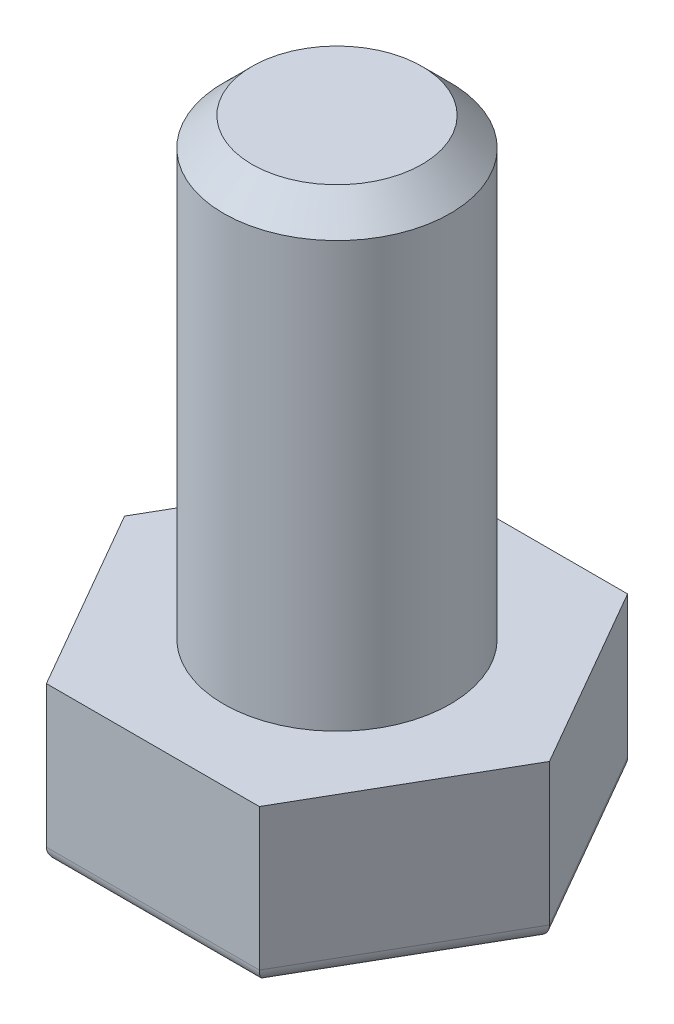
ISO-10303-21;
HEADER;
FILE_DESCRIPTION(('STEP AP214'),'2;1');
FILE_NAME('part.step','',(''),(''),'','','');
FILE_SCHEMA(('AUTOMOTIVE_DESIGN { 1 0 10303 214 1 1 1 1 }'));
ENDSEC;
DATA;
#1=APPLICATION_CONTEXT('core data for automotive mechanical design processes');
#2=APPLICATION_PROTOCOL_DEFINITION('international standard','automotive_design',2000,#1);
#3=PRODUCT_CONTEXT('',#1,'mechanical');
#4=PRODUCT('Part','Part','',(#3));
#5=PRODUCT_RELATED_PRODUCT_CATEGORY('part','',(#4));
#6=PRODUCT_DEFINITION_FORMATION('','',#4);
#7=PRODUCT_DEFINITION_CONTEXT('part definition',#1,'design');
#8=PRODUCT_DEFINITION('design','',#6,#7);
#9=PRODUCT_DEFINITION_SHAPE('','',#8);
#10=(LENGTH_UNIT() NAMED_UNIT(*) SI_UNIT(.MILLI.,.METRE.));
#11=(NAMED_UNIT(*) PLANE_ANGLE_UNIT() SI_UNIT($,.RADIAN.));
#12=(NAMED_UNIT(*) SI_UNIT($,.STERADIAN.) SOLID_ANGLE_UNIT());
#13=UNCERTAINTY_MEASURE_WITH_UNIT(LENGTH_MEASURE(1.E-05),#10,'distance_accuracy_value','');
#14=(GEOMETRIC_REPRESENTATION_CONTEXT(3) GLOBAL_UNCERTAINTY_ASSIGNED_CONTEXT((#13)) GLOBAL_UNIT_ASSIGNED_CONTEXT((#10,
#11,#12)) REPRESENTATION_CONTEXT('',''));
#15=CARTESIAN_POINT('',(0.,0.,0.));
#16=DIRECTION('',(0.,0.,1.));
#17=DIRECTION('',(1.,0.,0.));
#18=AXIS2_PLACEMENT_3D('',#15,#16,#17);
#19=CARTESIAN_POINT('',(3.75834261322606,5.5,6.5));
#20=DIRECTION('',(0.,1.,0.));
#21=DIRECTION('',(0.,0.,1.));
#22=AXIS2_PLACEMENT_3D('',#19,#20,#21);
#23=PLANE('',#22);
#24=DIRECTION('',(1.,0.,0.));
#25=VECTOR('',#24,1.);
#26=CARTESIAN_POINT('',(-3.75834261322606,5.5,6.5));
#27=LINE('',#26,#25);
#28=CARTESIAN_POINT('',(-3.75834261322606,5.5,6.5));
#29=VERTEX_POINT('',#28);
#30=CARTESIAN_POINT('',(3.75834261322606,5.5,6.5));
#31=VERTEX_POINT('',#30);
#32=EDGE_CURVE('E110',#29,#31,#27,.T.);
#33=ORIENTED_EDGE('',*,*,#32,.T.);
#34=DIRECTION('',(0.498887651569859,0.,-0.866666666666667));
#35=VECTOR('',#34,1.);
#36=CARTESIAN_POINT('',(3.75834261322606,5.5,6.5));
#37=LINE('',#36,#35);
#38=CARTESIAN_POINT('',(7.5,5.5,0.));
#39=VERTEX_POINT('',#38);
#40=EDGE_CURVE('E102',#31,#39,#37,.T.);
#41=ORIENTED_EDGE('',*,*,#40,.T.);
#42=DIRECTION('',(-0.498887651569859,0.,-0.866666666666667));
#43=VECTOR('',#42,1.);
#44=CARTESIAN_POINT('',(3.75834261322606,5.5,-6.5));
#45=LINE('',#44,#43);
#46=CARTESIAN_POINT('',(3.75834261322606,5.5,-6.5));
#47=VERTEX_POINT('',#46);
#48=EDGE_CURVE('E109',#39,#47,#45,.T.);
#49=ORIENTED_EDGE('',*,*,#48,.T.);
#50=DIRECTION('',(-1.,0.,0.));
#51=VECTOR('',#50,1.);
#52=CARTESIAN_POINT('',(-3.75834261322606,5.5,-6.5));
#53=LINE('',#52,#51);
#54=CARTESIAN_POINT('',(-3.75834261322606,5.5,-6.5));
#55=VERTEX_POINT('',#54);
#56=EDGE_CURVE('E335',#47,#55,#53,.T.);
#57=ORIENTED_EDGE('',*,*,#56,.T.);
#58=DIRECTION('',(-0.498887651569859,0.,0.866666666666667));
#59=VECTOR('',#58,1.);
#60=CARTESIAN_POINT('',(-3.75834261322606,5.5,-6.5));
#61=LINE('',#60,#59);
#62=CARTESIAN_POINT('',(-7.5,5.5,0.));
#63=VERTEX_POINT('',#62);
#64=EDGE_CURVE('E337',#55,#63,#61,.T.);
#65=ORIENTED_EDGE('',*,*,#64,.T.);
#66=DIRECTION('',(0.498887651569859,0.,0.866666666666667));
#67=VECTOR('',#66,1.);
#68=CARTESIAN_POINT('',(-3.75834261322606,5.5,6.5));
#69=LINE('',#68,#67);
#70=EDGE_CURVE('E115',#63,#29,#69,.T.);
#71=ORIENTED_EDGE('',*,*,#70,.T.);
#72=EDGE_LOOP('',(#33,#41,#49,#57,#65,#71));
#73=FACE_BOUND('',#72,.T.);
#74=CARTESIAN_POINT('',(0.,5.5,0.));
#75=DIRECTION('',(0.,1.,0.));
#76=DIRECTION('',(0.,0.,1.));
#77=AXIS2_PLACEMENT_3D('',#74,#75,#76);
#78=CIRCLE('',#77,4.);
#79=CARTESIAN_POINT('',(0.,5.5,4.));
#80=VERTEX_POINT('',#79);
#81=EDGE_CURVE('E316',#80,#80,#78,.T.);
#82=ORIENTED_EDGE('',*,*,#81,.F.);
#83=EDGE_LOOP('',(#82));
#84=FACE_BOUND('',#83,.T.);
#85=ADVANCED_FACE('F31',(#73,#84),#23,.T.);
#86=CARTESIAN_POINT('',(-3.75834261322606,5.5,6.5));
#87=DIRECTION('',(0.,0.,-1.));
#88=DIRECTION('',(-1.,0.,0.));
#89=AXIS2_PLACEMENT_3D('',#86,#87,#88);
#90=PLANE('',#89);
#91=DIRECTION('',(0.,-1.,0.));
#92=VECTOR('',#91,1.);
#93=CARTESIAN_POINT('',(-3.75834261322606,5.5,6.5));
#94=LINE('',#93,#92);
#95=CARTESIAN_POINT('',(-3.75834261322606,0.5,6.5));
#96=VERTEX_POINT('',#95);
#97=EDGE_CURVE('E340',#29,#96,#94,.T.);
#98=ORIENTED_EDGE('',*,*,#97,.T.);
#99=DIRECTION('',(1.,0.,0.));
#100=VECTOR('',#99,1.);
#101=CARTESIAN_POINT('',(-3.75834261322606,0.5,6.5));
#102=LINE('',#101,#100);
#103=CARTESIAN_POINT('',(3.75834261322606,0.5,6.5));
#104=VERTEX_POINT('',#103);
#105=EDGE_CURVE('E46',#96,#104,#102,.T.);
#106=ORIENTED_EDGE('',*,*,#105,.T.);
#107=DIRECTION('',(0.,-1.,0.));
#108=VECTOR('',#107,1.);
#109=CARTESIAN_POINT('',(3.75834261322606,5.5,6.5));
#110=LINE('',#109,#108);
#111=EDGE_CURVE('E105',#31,#104,#110,.T.);
#112=ORIENTED_EDGE('',*,*,#111,.F.);
#113=ORIENTED_EDGE('',*,*,#32,.F.);
#114=EDGE_LOOP('',(#98,#106,#112,#113));
#115=FACE_BOUND('',#114,.T.);
#116=ADVANCED_FACE('F33',(#115),#90,.F.);
#117=CARTESIAN_POINT('',(3.75834261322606,5.5,6.5));
#118=DIRECTION('',(-0.866666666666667,0.,-0.498887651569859));
#119=DIRECTION('',(-0.498887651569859,0.,0.866666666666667));
#120=AXIS2_PLACEMENT_3D('',#117,#118,#119);
#121=PLANE('',#120);
#122=ORIENTED_EDGE('',*,*,#111,.T.);
#123=DIRECTION('',(0.498887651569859,0.,-0.866666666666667));
#124=VECTOR('',#123,1.);
#125=CARTESIAN_POINT('',(3.75834261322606,0.5,6.5));
#126=LINE('',#125,#124);
#127=CARTESIAN_POINT('',(7.5,0.5,0.));
#128=VERTEX_POINT('',#127);
#129=EDGE_CURVE('E53',#104,#128,#126,.T.);
#130=ORIENTED_EDGE('',*,*,#129,.T.);
#131=DIRECTION('',(0.,-1.,0.));
#132=VECTOR('',#131,1.);
#133=CARTESIAN_POINT('',(7.5,5.5,0.));
#134=LINE('',#133,#132);
#135=EDGE_CURVE('E106',#39,#128,#134,.T.);
#136=ORIENTED_EDGE('',*,*,#135,.F.);
#137=ORIENTED_EDGE('',*,*,#40,.F.);
#138=EDGE_LOOP('',(#122,#130,#136,#137));
#139=FACE_BOUND('',#138,.T.);
#140=ADVANCED_FACE('F104',(#139),#121,.F.);
#141=CARTESIAN_POINT('',(3.75834261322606,5.5,-6.5));
#142=DIRECTION('',(-0.866666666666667,0.,0.498887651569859));
#143=DIRECTION('',(0.498887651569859,0.,0.866666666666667));
#144=AXIS2_PLACEMENT_3D('',#141,#142,#143);
#145=PLANE('',#144);
#146=ORIENTED_EDGE('',*,*,#135,.T.);
#147=DIRECTION('',(-0.498887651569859,0.,-0.866666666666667));
#148=VECTOR('',#147,1.);
#149=CARTESIAN_POINT('',(3.75834261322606,0.5,-6.5));
#150=LINE('',#149,#148);
#151=CARTESIAN_POINT('',(3.75834261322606,0.5,-6.5));
#152=VERTEX_POINT('',#151);
#153=EDGE_CURVE('E144',#128,#152,#150,.T.);
#154=ORIENTED_EDGE('',*,*,#153,.T.);
#155=DIRECTION('',(0.,-1.,0.));
#156=VECTOR('',#155,1.);
#157=CARTESIAN_POINT('',(3.75834261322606,5.5,-6.5));
#158=LINE('',#157,#156);
#159=EDGE_CURVE('E124',#47,#152,#158,.T.);
#160=ORIENTED_EDGE('',*,*,#159,.F.);
#161=ORIENTED_EDGE('',*,*,#48,.F.);
#162=EDGE_LOOP('',(#146,#154,#160,#161));
#163=FACE_BOUND('',#162,.T.);
#164=ADVANCED_FACE('F182',(#163),#145,.F.);
#165=CARTESIAN_POINT('',(-3.75834261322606,5.5,-6.5));
#166=DIRECTION('',(0.,0.,1.));
#167=DIRECTION('',(1.,0.,0.));
#168=AXIS2_PLACEMENT_3D('',#165,#166,#167);
#169=PLANE('',#168);
#170=ORIENTED_EDGE('',*,*,#159,.T.);
#171=DIRECTION('',(-1.,0.,0.));
#172=VECTOR('',#171,1.);
#173=CARTESIAN_POINT('',(-3.75834261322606,0.5,-6.5));
#174=LINE('',#173,#172);
#175=CARTESIAN_POINT('',(-3.75834261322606,0.5,-6.5));
#176=VERTEX_POINT('',#175);
#177=EDGE_CURVE('E142',#152,#176,#174,.T.);
#178=ORIENTED_EDGE('',*,*,#177,.T.);
#179=DIRECTION('',(0.,-1.,0.));
#180=VECTOR('',#179,1.);
#181=CARTESIAN_POINT('',(-3.75834261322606,5.5,-6.5));
#182=LINE('',#181,#180);
#183=EDGE_CURVE('E345',#55,#176,#182,.T.);
#184=ORIENTED_EDGE('',*,*,#183,.F.);
#185=ORIENTED_EDGE('',*,*,#56,.F.);
#186=EDGE_LOOP('',(#170,#178,#184,#185));
#187=FACE_BOUND('',#186,.T.);
#188=ADVANCED_FACE('F178',(#187),#169,.F.);
#189=CARTESIAN_POINT('',(-3.75834261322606,5.5,-6.5));
#190=DIRECTION('',(0.866666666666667,0.,0.498887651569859));
#191=DIRECTION('',(0.498887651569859,0.,-0.866666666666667));
#192=AXIS2_PLACEMENT_3D('',#189,#190,#191);
#193=PLANE('',#192);
#194=ORIENTED_EDGE('',*,*,#183,.T.);
#195=DIRECTION('',(-0.498887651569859,0.,0.866666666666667));
#196=VECTOR('',#195,1.);
#197=CARTESIAN_POINT('',(-3.75834261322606,0.5,-6.5));
#198=LINE('',#197,#196);
#199=CARTESIAN_POINT('',(-7.5,0.5,0.));
#200=VERTEX_POINT('',#199);
#201=EDGE_CURVE('E140',#176,#200,#198,.T.);
#202=ORIENTED_EDGE('',*,*,#201,.T.);
#203=DIRECTION('',(0.,-1.,0.));
#204=VECTOR('',#203,1.);
#205=CARTESIAN_POINT('',(-7.5,5.5,0.));
#206=LINE('',#205,#204);
#207=EDGE_CURVE('E342',#63,#200,#206,.T.);
#208=ORIENTED_EDGE('',*,*,#207,.F.);
#209=ORIENTED_EDGE('',*,*,#64,.F.);
#210=EDGE_LOOP('',(#194,#202,#208,#209));
#211=FACE_BOUND('',#210,.T.);
#212=ADVANCED_FACE('F174',(#211),#193,.F.);
#213=CARTESIAN_POINT('',(-3.75834261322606,5.5,6.5));
#214=DIRECTION('',(0.866666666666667,0.,-0.498887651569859));
#215=DIRECTION('',(-0.498887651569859,0.,-0.866666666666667));
#216=AXIS2_PLACEMENT_3D('',#213,#214,#215);
#217=PLANE('',#216);
#218=ORIENTED_EDGE('',*,*,#207,.T.);
#219=DIRECTION('',(0.498887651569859,0.,0.866666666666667));
#220=VECTOR('',#219,1.);
#221=CARTESIAN_POINT('',(-3.75834261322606,0.5,6.5));
#222=LINE('',#221,#220);
#223=EDGE_CURVE('E119',#200,#96,#222,.T.);
#224=ORIENTED_EDGE('',*,*,#223,.T.);
#225=ORIENTED_EDGE('',*,*,#97,.F.);
#226=ORIENTED_EDGE('',*,*,#70,.F.);
#227=EDGE_LOOP('',(#218,#224,#225,#226));
#228=FACE_BOUND('',#227,.T.);
#229=ADVANCED_FACE('F171',(#228),#217,.F.);
#230=CARTESIAN_POINT('',(3.75834261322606,0.,6.5));
#231=DIRECTION('',(0.,1.,0.));
#232=DIRECTION('',(0.,0.,1.));
#233=AXIS2_PLACEMENT_3D('',#230,#231,#232);
#234=PLANE('',#233);
#235=DIRECTION('',(1.,0.,0.));
#236=VECTOR('',#235,1.);
#237=CARTESIAN_POINT('',(3.75834261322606,0.,6.));
#238=LINE('',#237,#236);
#239=CARTESIAN_POINT('',(3.46923933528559,0.,6.));
#240=VERTEX_POINT('',#239);
#241=CARTESIAN_POINT('',(-3.46923933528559,0.,6.));
#242=VERTEX_POINT('',#241);
#243=EDGE_CURVE('E122',#240,#242,#238,.F.);
#244=ORIENTED_EDGE('',*,*,#243,.T.);
#245=DIRECTION('',(0.498887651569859,0.,0.866666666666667));
#246=VECTOR('',#245,1.);
#247=CARTESIAN_POINT('',(-1.45418984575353,0.,9.50054008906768));
#248=LINE('',#247,#246);
#249=CARTESIAN_POINT('',(-6.92307692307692,0.,0.));
#250=VERTEX_POINT('',#249);
#251=EDGE_CURVE('E137',#242,#250,#248,.F.);
#252=ORIENTED_EDGE('',*,*,#251,.T.);
#253=DIRECTION('',(-0.498887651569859,0.,0.866666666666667));
#254=VECTOR('',#253,1.);
#255=CARTESIAN_POINT('',(-7.07499072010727,0.,0.263904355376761));
#256=LINE('',#255,#254);
#257=CARTESIAN_POINT('',(-3.46923933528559,0.,-6.));
#258=VERTEX_POINT('',#257);
#259=EDGE_CURVE('E135',#250,#258,#256,.F.);
#260=ORIENTED_EDGE('',*,*,#259,.T.);
#261=DIRECTION('',(-1.,0.,0.));
#262=VECTOR('',#261,1.);
#263=CARTESIAN_POINT('',(3.75834261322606,0.,-6.));
#264=LINE('',#263,#262);
#265=CARTESIAN_POINT('',(3.46923933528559,0.,-6.));
#266=VERTEX_POINT('',#265);
#267=EDGE_CURVE('E133',#258,#266,#264,.F.);
#268=ORIENTED_EDGE('',*,*,#267,.T.);
#269=DIRECTION('',(-0.498887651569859,0.,-0.866666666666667));
#270=VECTOR('',#269,1.);
#271=CARTESIAN_POINT('',(8.94581015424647,0.,3.51388827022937));
#272=LINE('',#271,#270);
#273=CARTESIAN_POINT('',(6.92307692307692,0.,0.));
#274=VERTEX_POINT('',#273);
#275=EDGE_CURVE('E131',#266,#274,#272,.F.);
#276=ORIENTED_EDGE('',*,*,#275,.T.);
#277=DIRECTION('',(0.498887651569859,0.,-0.866666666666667));
#278=VECTOR('',#277,1.);
#279=CARTESIAN_POINT('',(3.32500927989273,0.,6.25055617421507));
#280=LINE('',#279,#278);
#281=EDGE_CURVE('E129',#274,#240,#280,.F.);
#282=ORIENTED_EDGE('',*,*,#281,.T.);
#283=EDGE_LOOP('',(#244,#252,#260,#268,#276,#282));
#284=FACE_BOUND('',#283,.T.);
#285=ADVANCED_FACE('F169',(#284),#234,.F.);
#286=CARTESIAN_POINT('',(3.32500927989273,0.5,-6.25055617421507));
#287=DIRECTION('',(-0.498887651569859,0.,-0.866666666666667));
#288=DIRECTION('',(-0.866666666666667,0.,0.498887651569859));
#289=AXIS2_PLACEMENT_3D('',#286,#287,#288);
#290=CYLINDRICAL_SURFACE('',#289,0.5);
#291=CARTESIAN_POINT('',(6.92307692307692,0.5,0.));
#292=DIRECTION('',(0.,0.,-1.));
#293=DIRECTION('',(1.,0.,0.));
#294=AXIS2_PLACEMENT_3D('',#291,#292,#293);
#295=ELLIPSE('',#294,0.576923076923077,0.5);
#296=EDGE_CURVE('E329',#274,#128,#295,.F.);
#297=ORIENTED_EDGE('',*,*,#296,.F.);
#298=ORIENTED_EDGE('',*,*,#275,.F.);
#299=CARTESIAN_POINT('',(3.46923933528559,0.5,-6.));
#300=DIRECTION('',(-0.865704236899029,0.,-0.500555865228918));
#301=DIRECTION('',(0.500555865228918,0.,-0.865704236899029));
#302=AXIS2_PLACEMENT_3D('',#299,#300,#301);
#303=ELLIPSE('',#302,0.577564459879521,0.5);
#304=EDGE_CURVE('E117',#152,#266,#303,.T.);
#305=ORIENTED_EDGE('',*,*,#304,.F.);
#306=ORIENTED_EDGE('',*,*,#153,.F.);
#307=EDGE_LOOP('',(#297,#298,#305,#306));
#308=FACE_BOUND('',#307,.T.);
#309=ADVANCED_FACE('F213',(#308),#290,.T.);
#310=CARTESIAN_POINT('',(-3.75834261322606,0.5,-6.));
#311=DIRECTION('',(-1.,0.,0.));
#312=DIRECTION('',(0.,0.,1.));
#313=AXIS2_PLACEMENT_3D('',#310,#311,#312);
#314=CYLINDRICAL_SURFACE('',#313,0.5);
#315=ORIENTED_EDGE('',*,*,#304,.T.);
#316=ORIENTED_EDGE('',*,*,#267,.F.);
#317=CARTESIAN_POINT('',(-3.46923933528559,0.5,-6.));
#318=DIRECTION('',(-0.865704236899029,0.,0.500555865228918));
#319=DIRECTION('',(-0.500555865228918,0.,-0.865704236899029));
#320=AXIS2_PLACEMENT_3D('',#317,#318,#319);
#321=ELLIPSE('',#320,0.577564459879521,0.5);
#322=EDGE_CURVE('E326',#176,#258,#321,.T.);
#323=ORIENTED_EDGE('',*,*,#322,.F.);
#324=ORIENTED_EDGE('',*,*,#177,.F.);
#325=EDGE_LOOP('',(#315,#316,#323,#324));
#326=FACE_BOUND('',#325,.T.);
#327=ADVANCED_FACE('F220',(#326),#314,.T.);
#328=CARTESIAN_POINT('',(3.32500927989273,0.5,6.25055617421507));
#329=DIRECTION('',(0.498887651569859,0.,-0.866666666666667));
#330=DIRECTION('',(-0.866666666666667,0.,-0.498887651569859));
#331=AXIS2_PLACEMENT_3D('',#328,#329,#330);
#332=CYLINDRICAL_SURFACE('',#331,0.5);
#333=ORIENTED_EDGE('',*,*,#296,.T.);
#334=ORIENTED_EDGE('',*,*,#129,.F.);
#335=CARTESIAN_POINT('',(3.46923933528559,0.5,6.));
#336=DIRECTION('',(0.865704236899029,0.,-0.500555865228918));
#337=DIRECTION('',(0.500555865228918,0.,0.865704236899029));
#338=AXIS2_PLACEMENT_3D('',#335,#336,#337);
#339=ELLIPSE('',#338,0.577564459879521,0.5);
#340=EDGE_CURVE('E323',#240,#104,#339,.F.);
#341=ORIENTED_EDGE('',*,*,#340,.F.);
#342=ORIENTED_EDGE('',*,*,#281,.F.);
#343=EDGE_LOOP('',(#333,#334,#341,#342));
#344=FACE_BOUND('',#343,.T.);
#345=ADVANCED_FACE('F227',(#344),#332,.T.);
#346=CARTESIAN_POINT('',(-3.32500927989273,0.5,-6.25055617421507));
#347=DIRECTION('',(-0.498887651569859,0.,0.866666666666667));
#348=DIRECTION('',(0.866666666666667,0.,0.498887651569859));
#349=AXIS2_PLACEMENT_3D('',#346,#347,#348);
#350=CYLINDRICAL_SURFACE('',#349,0.5);
#351=ORIENTED_EDGE('',*,*,#322,.T.);
#352=ORIENTED_EDGE('',*,*,#259,.F.);
#353=CARTESIAN_POINT('',(-6.92307692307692,0.5,0.));
#354=DIRECTION('',(0.,0.,1.));
#355=DIRECTION('',(-1.,0.,0.));
#356=AXIS2_PLACEMENT_3D('',#353,#354,#355);
#357=ELLIPSE('',#356,0.576923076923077,0.5);
#358=EDGE_CURVE('E319',#200,#250,#357,.T.);
#359=ORIENTED_EDGE('',*,*,#358,.F.);
#360=ORIENTED_EDGE('',*,*,#201,.F.);
#361=EDGE_LOOP('',(#351,#352,#359,#360));
#362=FACE_BOUND('',#361,.T.);
#363=ADVANCED_FACE('F235',(#362),#350,.T.);
#364=CARTESIAN_POINT('',(-3.75834261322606,0.5,6.));
#365=DIRECTION('',(1.,0.,0.));
#366=DIRECTION('',(0.,0.,-1.));
#367=AXIS2_PLACEMENT_3D('',#364,#365,#366);
#368=CYLINDRICAL_SURFACE('',#367,0.5);
#369=ORIENTED_EDGE('',*,*,#340,.T.);
#370=ORIENTED_EDGE('',*,*,#105,.F.);
#371=CARTESIAN_POINT('',(-3.46923933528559,0.5,6.));
#372=DIRECTION('',(0.865704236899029,0.,0.500555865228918));
#373=DIRECTION('',(0.500555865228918,0.,-0.865704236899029));
#374=AXIS2_PLACEMENT_3D('',#371,#372,#373);
#375=ELLIPSE('',#374,0.577564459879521,0.5);
#376=EDGE_CURVE('E317',#242,#96,#375,.F.);
#377=ORIENTED_EDGE('',*,*,#376,.F.);
#378=ORIENTED_EDGE('',*,*,#243,.F.);
#379=EDGE_LOOP('',(#369,#370,#377,#378));
#380=FACE_BOUND('',#379,.T.);
#381=ADVANCED_FACE('F243',(#380),#368,.T.);
#382=CARTESIAN_POINT('',(-3.32500927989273,0.5,6.25055617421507));
#383=DIRECTION('',(0.498887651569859,0.,0.866666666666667));
#384=DIRECTION('',(0.866666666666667,0.,-0.498887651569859));
#385=AXIS2_PLACEMENT_3D('',#382,#383,#384);
#386=CYLINDRICAL_SURFACE('',#385,0.5);
#387=ORIENTED_EDGE('',*,*,#358,.T.);
#388=ORIENTED_EDGE('',*,*,#251,.F.);
#389=ORIENTED_EDGE('',*,*,#376,.T.);
#390=ORIENTED_EDGE('',*,*,#223,.F.);
#391=EDGE_LOOP('',(#387,#388,#389,#390));
#392=FACE_BOUND('',#391,.T.);
#393=ADVANCED_FACE('F251',(#392),#386,.T.);
#394=CARTESIAN_POINT('',(0.,21.5,0.));
#395=DIRECTION('',(0.,-1.,0.));
#396=DIRECTION('',(0.,0.,-1.));
#397=AXIS2_PLACEMENT_3D('',#394,#395,#396);
#398=CYLINDRICAL_SURFACE('',#397,4.);
#399=CARTESIAN_POINT('',(0.,20.5,0.));
#400=DIRECTION('',(0.,1.,0.));
#401=DIRECTION('',(0.,0.,1.));
#402=AXIS2_PLACEMENT_3D('',#399,#400,#401);
#403=CIRCLE('',#402,4.);
#404=CARTESIAN_POINT('',(0.,20.5,4.));
#405=VERTEX_POINT('',#404);
#406=EDGE_CURVE('E11',#405,#405,#403,.F.);
#407=ORIENTED_EDGE('',*,*,#406,.T.);
#408=EDGE_LOOP('',(#407));
#409=FACE_BOUND('',#408,.T.);
#410=ORIENTED_EDGE('',*,*,#81,.T.);
#411=EDGE_LOOP('',(#410));
#412=FACE_BOUND('',#411,.T.);
#413=ADVANCED_FACE('F159',(#409,#412),#398,.T.);
#414=CARTESIAN_POINT('',(0.,21.5,0.));
#415=DIRECTION('',(0.,1.,0.));
#416=DIRECTION('',(0.,0.,1.));
#417=AXIS2_PLACEMENT_3D('',#414,#415,#416);
#418=PLANE('',#417);
#419=CARTESIAN_POINT('',(0.,21.5,0.));
#420=DIRECTION('',(0.,1.,0.));
#421=DIRECTION('',(0.,0.,1.));
#422=AXIS2_PLACEMENT_3D('',#419,#420,#421);
#423=CIRCLE('',#422,3.);
#424=CARTESIAN_POINT('',(0.,21.5,3.));
#425=VERTEX_POINT('',#424);
#426=EDGE_CURVE('E39',#425,#425,#423,.T.);
#427=ORIENTED_EDGE('',*,*,#426,.T.);
#428=EDGE_LOOP('',(#427));
#429=FACE_BOUND('',#428,.T.);
#430=ADVANCED_FACE('F150',(#429),#418,.T.);
#431=CARTESIAN_POINT('',(0.,21.5,0.));
#432=DIRECTION('',(0.,-1.,0.));
#433=DIRECTION('',(0.,0.,-1.));
#434=AXIS2_PLACEMENT_3D('',#431,#432,#433);
#435=CONICAL_SURFACE('',#434,3.,0.785398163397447);
#436=ORIENTED_EDGE('',*,*,#406,.F.);
#437=EDGE_LOOP('',(#436));
#438=FACE_BOUND('',#437,.T.);
#439=ORIENTED_EDGE('',*,*,#426,.F.);
#440=EDGE_LOOP('',(#439));
#441=FACE_BOUND('',#440,.T.);
#442=ADVANCED_FACE('F152',(#438,#441),#435,.T.);
#443=CLOSED_SHELL('',(#85,#116,#140,#164,#188,#212,#229,#285,#309,#327,#345,#363,#381,#393,#413,
#430,#442));
#444=MANIFOLD_SOLID_BREP('B2',#443);
#445=ADVANCED_BREP_SHAPE_REPRESENTATION('',(#18,#444),#14);
#446=SHAPE_DEFINITION_REPRESENTATION(#9,#445);
ENDSEC;
END-ISO-10303-21;
